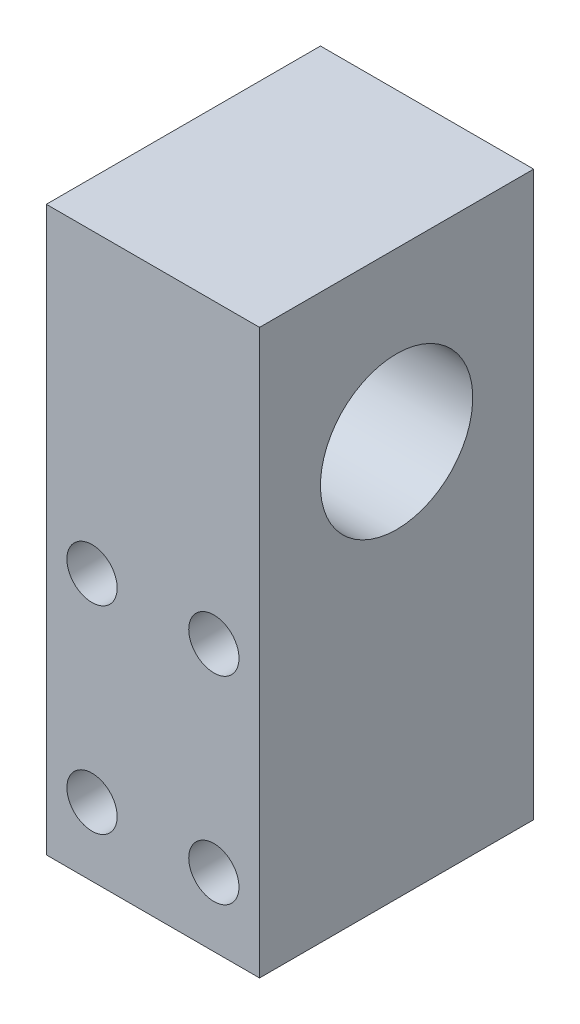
from build123d import *

# Parameters (mm, degrees)
SKETCH_1_W          = 14
SKETCH_1_H          = 37
EXTRUDE_1_DEPTH     = 18
SKETCH_2_R          = 5
CUT_EXTRUDE_1_DEPTH = 18
HOLE_WIZARD_M4_2_D  = 3.3


with BuildPart() as part:
    # Sketch 1 → Extrude 1 (new body)
    with BuildSketch(Plane.XY):
        Rectangle(SKETCH_1_W, SKETCH_1_H)
    extrude(amount=EXTRUDE_1_DEPTH)

    # Sketch 2 → Cut-Extrude 1 (cut)
    with BuildSketch(Plane(origin=(7, 0, 0), x_dir=(0, 0, -1), z_dir=(1, 0, 0))):
        with Locations(Location((-9, 7.5, 0), (0, 0, 90))):
            Circle(SKETCH_2_R)
    extrude(amount=-CUT_EXTRUDE_1_DEPTH, mode=Mode.SUBTRACT)

    # Hole Wizard M4 _2 (through all)
    with Locations(Plane(origin=(0, 0, 0), x_dir=(-1, 0, 0), z_dir=(0, 0, -1))):
        with Locations((-4, -1), (4, -1), (-4, -14), (4, -14)):
            Hole(HOLE_WIZARD_M4_2_D / 2)


solid = part.part
